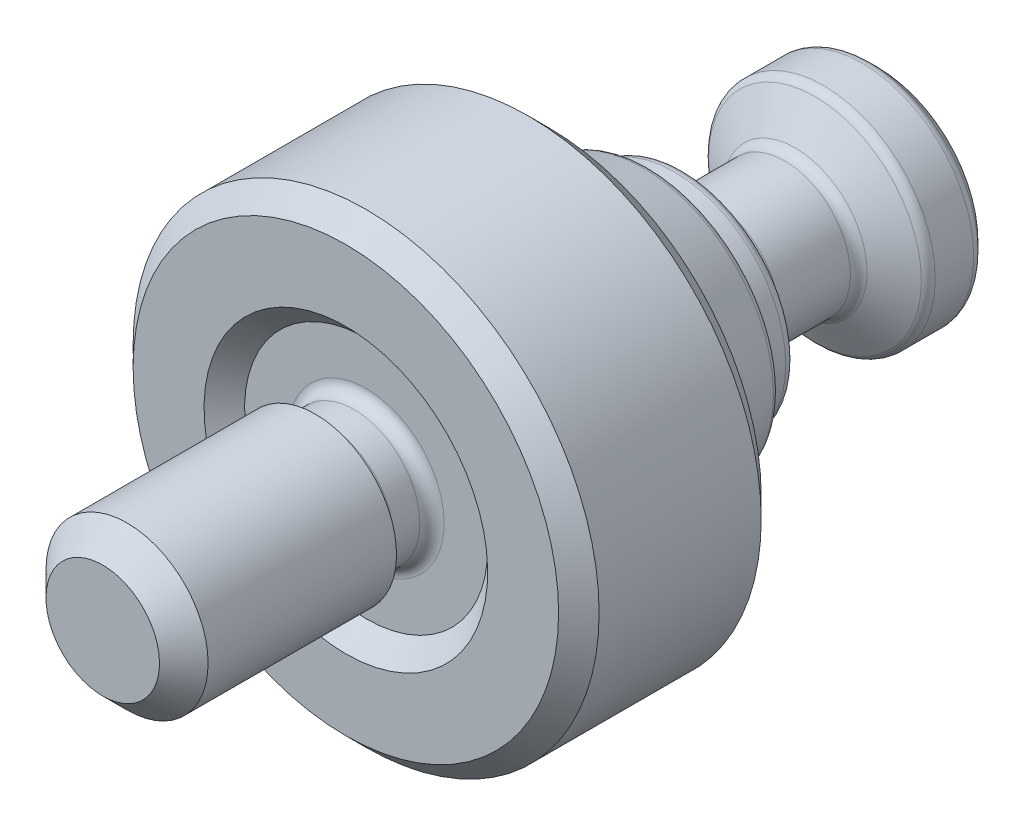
ISO-10303-21;
HEADER;
FILE_DESCRIPTION(('STEP AP214'),'2;1');
FILE_NAME('part.step','',(''),(''),'','','');
FILE_SCHEMA(('AUTOMOTIVE_DESIGN { 1 0 10303 214 1 1 1 1 }'));
ENDSEC;
DATA;
#1=APPLICATION_CONTEXT('core data for automotive mechanical design processes');
#2=APPLICATION_PROTOCOL_DEFINITION('international standard','automotive_design',2000,#1);
#3=PRODUCT_CONTEXT('',#1,'mechanical');
#4=PRODUCT('Part','Part','',(#3));
#5=PRODUCT_RELATED_PRODUCT_CATEGORY('part','',(#4));
#6=PRODUCT_DEFINITION_FORMATION('','',#4);
#7=PRODUCT_DEFINITION_CONTEXT('part definition',#1,'design');
#8=PRODUCT_DEFINITION('design','',#6,#7);
#9=PRODUCT_DEFINITION_SHAPE('','',#8);
#10=(LENGTH_UNIT() NAMED_UNIT(*) SI_UNIT(.MILLI.,.METRE.));
#11=(NAMED_UNIT(*) PLANE_ANGLE_UNIT() SI_UNIT($,.RADIAN.));
#12=(NAMED_UNIT(*) SI_UNIT($,.STERADIAN.) SOLID_ANGLE_UNIT());
#13=UNCERTAINTY_MEASURE_WITH_UNIT(LENGTH_MEASURE(1.E-05),#10,'distance_accuracy_value','');
#14=(GEOMETRIC_REPRESENTATION_CONTEXT(3) GLOBAL_UNCERTAINTY_ASSIGNED_CONTEXT((#13)) GLOBAL_UNIT_ASSIGNED_CONTEXT((#10,
#11,#12)) REPRESENTATION_CONTEXT('',''));
#15=CARTESIAN_POINT('',(0.,0.,0.));
#16=DIRECTION('',(0.,0.,1.));
#17=DIRECTION('',(1.,0.,0.));
#18=AXIS2_PLACEMENT_3D('',#15,#16,#17);
#19=CARTESIAN_POINT('',(0.,0.,9.));
#20=DIRECTION('',(0.,0.,-1.));
#21=DIRECTION('',(1.,0.,0.));
#22=AXIS2_PLACEMENT_3D('',#19,#20,#21);
#23=PLANE('',#22);
#24=CARTESIAN_POINT('',(0.,0.,9.));
#25=DIRECTION('',(0.,0.,1.));
#26=DIRECTION('',(0.,-1.,0.));
#27=AXIS2_PLACEMENT_3D('',#24,#25,#26);
#28=CIRCLE('',#27,3.85);
#29=CARTESIAN_POINT('',(0.,-3.85,9.));
#30=VERTEX_POINT('',#29);
#31=EDGE_CURVE('E23',#30,#30,#28,.T.);
#32=ORIENTED_EDGE('',*,*,#31,.F.);
#33=EDGE_LOOP('',(#32));
#34=FACE_BOUND('',#33,.T.);
#35=CARTESIAN_POINT('',(0.,0.,9.));
#36=DIRECTION('',(0.,0.,1.));
#37=DIRECTION('',(0.,-1.,0.));
#38=AXIS2_PLACEMENT_3D('',#35,#36,#37);
#39=CIRCLE('',#38,6.);
#40=CARTESIAN_POINT('',(0.,-6.,9.));
#41=VERTEX_POINT('',#40);
#42=EDGE_CURVE('E188',#41,#41,#39,.T.);
#43=ORIENTED_EDGE('',*,*,#42,.T.);
#44=EDGE_LOOP('',(#43));
#45=FACE_BOUND('',#44,.T.);
#46=ADVANCED_FACE('F14',(#34,#45),#23,.F.);
#47=CARTESIAN_POINT('',(0.,0.,22.));
#48=DIRECTION('',(0.,0.,1.));
#49=DIRECTION('',(0.,-1.,0.));
#50=AXIS2_PLACEMENT_3D('',#47,#48,#49);
#51=PLANE('',#50);
#52=CARTESIAN_POINT('',(0.,0.,22.));
#53=DIRECTION('',(0.,0.,1.));
#54=DIRECTION('',(0.,-1.,0.));
#55=AXIS2_PLACEMENT_3D('',#52,#53,#54);
#56=CIRCLE('',#55,2.8);
#57=CARTESIAN_POINT('',(0.,-2.8,22.));
#58=VERTEX_POINT('',#57);
#59=EDGE_CURVE('E119',#58,#58,#56,.T.);
#60=ORIENTED_EDGE('',*,*,#59,.T.);
#61=EDGE_LOOP('',(#60));
#62=FACE_BOUND('',#61,.T.);
#63=ADVANCED_FACE('F296',(#62),#51,.T.);
#64=CARTESIAN_POINT('',(0.,0.,20.8));
#65=DIRECTION('',(0.,0.,-1.));
#66=DIRECTION('',(0.,1.,0.));
#67=AXIS2_PLACEMENT_3D('',#64,#65,#66);
#68=CONICAL_SURFACE('',#67,4.,0.785398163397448);
#69=ORIENTED_EDGE('',*,*,#59,.F.);
#70=EDGE_LOOP('',(#69));
#71=FACE_BOUND('',#70,.T.);
#72=CARTESIAN_POINT('',(0.,0.,20.8));
#73=DIRECTION('',(0.,0.,1.));
#74=DIRECTION('',(0.,-1.,0.));
#75=AXIS2_PLACEMENT_3D('',#72,#73,#74);
#76=CIRCLE('',#75,4.);
#77=CARTESIAN_POINT('',(0.,-4.,20.8));
#78=VERTEX_POINT('',#77);
#79=EDGE_CURVE('E116',#78,#78,#76,.F.);
#80=ORIENTED_EDGE('',*,*,#79,.F.);
#81=EDGE_LOOP('',(#80));
#82=FACE_BOUND('',#81,.T.);
#83=ADVANCED_FACE('F289',(#71,#82),#68,.T.);
#84=CARTESIAN_POINT('',(0.,0.,0.));
#85=DIRECTION('',(0.,0.,-1.));
#86=DIRECTION('',(0.,1.,0.));
#87=AXIS2_PLACEMENT_3D('',#84,#85,#86);
#88=CYLINDRICAL_SURFACE('',#87,4.);
#89=CARTESIAN_POINT('',(0.,0.,11.5));
#90=DIRECTION('',(0.,0.,-1.));
#91=DIRECTION('',(0.,1.,0.));
#92=AXIS2_PLACEMENT_3D('',#89,#90,#91);
#93=CIRCLE('',#92,4.);
#94=CARTESIAN_POINT('',(0.,4.,11.5));
#95=VERTEX_POINT('',#94);
#96=EDGE_CURVE('E193',#95,#95,#93,.T.);
#97=ORIENTED_EDGE('',*,*,#96,.F.);
#98=EDGE_LOOP('',(#97));
#99=FACE_BOUND('',#98,.T.);
#100=ORIENTED_EDGE('',*,*,#79,.T.);
#101=EDGE_LOOP('',(#100));
#102=FACE_BOUND('',#101,.T.);
#103=ADVANCED_FACE('F280',(#99,#102),#88,.T.);
#104=CARTESIAN_POINT('',(4.,0.,11.5));
#105=DIRECTION('',(0.,0.,1.));
#106=DIRECTION('',(0.,-1.,0.));
#107=AXIS2_PLACEMENT_3D('',#104,#105,#106);
#108=PLANE('',#107);
#109=CARTESIAN_POINT('',(0.,0.,11.5));
#110=DIRECTION('',(0.,0.,1.));
#111=DIRECTION('',(0.,-1.,0.));
#112=AXIS2_PLACEMENT_3D('',#109,#110,#111);
#113=CIRCLE('',#112,3.85);
#114=CARTESIAN_POINT('',(0.,-3.85,11.5));
#115=VERTEX_POINT('',#114);
#116=EDGE_CURVE('E18',#115,#115,#113,.T.);
#117=ORIENTED_EDGE('',*,*,#116,.T.);
#118=EDGE_LOOP('',(#117));
#119=FACE_BOUND('',#118,.T.);
#120=ORIENTED_EDGE('',*,*,#96,.T.);
#121=EDGE_LOOP('',(#120));
#122=FACE_BOUND('',#121,.T.);
#123=ADVANCED_FACE('F277',(#119,#122),#108,.F.);
#124=CARTESIAN_POINT('',(0.,0.,10.9));
#125=DIRECTION('',(0.,0.,1.));
#126=DIRECTION('',(0.,-1.,0.));
#127=AXIS2_PLACEMENT_3D('',#124,#125,#126);
#128=TOROIDAL_SURFACE('',#127,3.85,0.6);
#129=ORIENTED_EDGE('',*,*,#116,.F.);
#130=EDGE_LOOP('',(#129));
#131=FACE_BOUND('',#130,.T.);
#132=CARTESIAN_POINT('',(0.,0.,10.9));
#133=DIRECTION('',(0.,0.,1.));
#134=DIRECTION('',(0.,-1.,0.));
#135=AXIS2_PLACEMENT_3D('',#132,#133,#134);
#136=CIRCLE('',#135,3.25);
#137=CARTESIAN_POINT('',(0.,-3.25,10.9));
#138=VERTEX_POINT('',#137);
#139=EDGE_CURVE('E163',#138,#138,#136,.F.);
#140=ORIENTED_EDGE('',*,*,#139,.F.);
#141=EDGE_LOOP('',(#140));
#142=FACE_BOUND('',#141,.T.);
#143=ADVANCED_FACE('F279',(#131,#142),#128,.F.);
#144=CARTESIAN_POINT('',(0.,0.,0.));
#145=DIRECTION('',(0.,0.,-1.));
#146=DIRECTION('',(0.,1.,0.));
#147=AXIS2_PLACEMENT_3D('',#144,#145,#146);
#148=CYLINDRICAL_SURFACE('',#147,3.25);
#149=ORIENTED_EDGE('',*,*,#139,.T.);
#150=EDGE_LOOP('',(#149));
#151=FACE_BOUND('',#150,.T.);
#152=CARTESIAN_POINT('',(0.,0.,9.6));
#153=DIRECTION('',(0.,0.,1.));
#154=DIRECTION('',(0.,-1.,0.));
#155=AXIS2_PLACEMENT_3D('',#152,#153,#154);
#156=CIRCLE('',#155,3.25);
#157=CARTESIAN_POINT('',(0.,-3.25,9.6));
#158=VERTEX_POINT('',#157);
#159=EDGE_CURVE('E161',#158,#158,#156,.T.);
#160=ORIENTED_EDGE('',*,*,#159,.T.);
#161=EDGE_LOOP('',(#160));
#162=FACE_BOUND('',#161,.T.);
#163=ADVANCED_FACE('F282',(#151,#162),#148,.T.);
#164=CARTESIAN_POINT('',(0.,0.,9.6));
#165=DIRECTION('',(0.,0.,1.));
#166=DIRECTION('',(0.,-1.,0.));
#167=AXIS2_PLACEMENT_3D('',#164,#165,#166);
#168=TOROIDAL_SURFACE('',#167,3.85,0.6);
#169=ORIENTED_EDGE('',*,*,#159,.F.);
#170=EDGE_LOOP('',(#169));
#171=FACE_BOUND('',#170,.T.);
#172=ORIENTED_EDGE('',*,*,#31,.T.);
#173=EDGE_LOOP('',(#172));
#174=FACE_BOUND('',#173,.T.);
#175=ADVANCED_FACE('F16',(#171,#174),#168,.F.);
#176=CARTESIAN_POINT('',(0.,0.,9.));
#177=DIRECTION('',(0.,0.,-1.));
#178=DIRECTION('',(0.,1.,0.));
#179=AXIS2_PLACEMENT_3D('',#176,#177,#178);
#180=CONICAL_SURFACE('',#179,11.5,0.785398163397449);
#181=CARTESIAN_POINT('',(0.,0.,10.));
#182=DIRECTION('',(0.,0.,1.));
#183=DIRECTION('',(0.,-1.,0.));
#184=AXIS2_PLACEMENT_3D('',#181,#182,#183);
#185=CIRCLE('',#184,10.5);
#186=CARTESIAN_POINT('',(0.,-10.5,10.));
#187=VERTEX_POINT('',#186);
#188=EDGE_CURVE('E177',#187,#187,#185,.T.);
#189=ORIENTED_EDGE('',*,*,#188,.F.);
#190=EDGE_LOOP('',(#189));
#191=FACE_BOUND('',#190,.T.);
#192=CARTESIAN_POINT('',(0.,0.,9.));
#193=DIRECTION('',(0.,0.,1.));
#194=DIRECTION('',(0.,-1.,0.));
#195=AXIS2_PLACEMENT_3D('',#192,#193,#194);
#196=CIRCLE('',#195,11.5);
#197=CARTESIAN_POINT('',(0.,-11.5,9.));
#198=VERTEX_POINT('',#197);
#199=EDGE_CURVE('E172',#198,#198,#196,.F.);
#200=ORIENTED_EDGE('',*,*,#199,.F.);
#201=EDGE_LOOP('',(#200));
#202=FACE_BOUND('',#201,.T.);
#203=ADVANCED_FACE('F301',(#191,#202),#180,.T.);
#204=CARTESIAN_POINT('',(6.,0.,10.));
#205=DIRECTION('',(0.,0.,1.));
#206=DIRECTION('',(0.,-1.,0.));
#207=AXIS2_PLACEMENT_3D('',#204,#205,#206);
#208=PLANE('',#207);
#209=CARTESIAN_POINT('',(0.,0.,10.));
#210=DIRECTION('',(0.,0.,1.));
#211=DIRECTION('',(0.,-1.,0.));
#212=AXIS2_PLACEMENT_3D('',#209,#210,#211);
#213=CIRCLE('',#212,7.);
#214=CARTESIAN_POINT('',(0.,-7.,10.));
#215=VERTEX_POINT('',#214);
#216=EDGE_CURVE('E185',#215,#215,#213,.F.);
#217=ORIENTED_EDGE('',*,*,#216,.T.);
#218=EDGE_LOOP('',(#217));
#219=FACE_BOUND('',#218,.T.);
#220=ORIENTED_EDGE('',*,*,#188,.T.);
#221=EDGE_LOOP('',(#220));
#222=FACE_BOUND('',#221,.T.);
#223=ADVANCED_FACE('F389',(#219,#222),#208,.T.);
#224=CARTESIAN_POINT('',(0.,0.,10.));
#225=DIRECTION('',(0.,0.,1.));
#226=DIRECTION('',(0.,-1.,0.));
#227=AXIS2_PLACEMENT_3D('',#224,#225,#226);
#228=CONICAL_SURFACE('',#227,7.,0.785398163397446);
#229=ORIENTED_EDGE('',*,*,#42,.F.);
#230=EDGE_LOOP('',(#229));
#231=FACE_BOUND('',#230,.T.);
#232=ORIENTED_EDGE('',*,*,#216,.F.);
#233=EDGE_LOOP('',(#232));
#234=FACE_BOUND('',#233,.T.);
#235=ADVANCED_FACE('F393',(#231,#234),#228,.F.);
#236=CARTESIAN_POINT('',(0.,0.,0.));
#237=DIRECTION('',(0.,0.,-1.));
#238=DIRECTION('',(0.,1.,0.));
#239=AXIS2_PLACEMENT_3D('',#236,#237,#238);
#240=CYLINDRICAL_SURFACE('',#239,11.5);
#241=ORIENTED_EDGE('',*,*,#199,.T.);
#242=EDGE_LOOP('',(#241));
#243=FACE_BOUND('',#242,.T.);
#244=CARTESIAN_POINT('',(0.,0.,1.));
#245=DIRECTION('',(0.,0.,-1.));
#246=DIRECTION('',(0.,1.,0.));
#247=AXIS2_PLACEMENT_3D('',#244,#245,#246);
#248=CIRCLE('',#247,11.5);
#249=CARTESIAN_POINT('',(0.,11.5,1.));
#250=VERTEX_POINT('',#249);
#251=EDGE_CURVE('E168',#250,#250,#248,.F.);
#252=ORIENTED_EDGE('',*,*,#251,.T.);
#253=EDGE_LOOP('',(#252));
#254=FACE_BOUND('',#253,.T.);
#255=ADVANCED_FACE('F383',(#243,#254),#240,.T.);
#256=CARTESIAN_POINT('',(0.,0.,0.));
#257=DIRECTION('',(0.,0.,1.));
#258=DIRECTION('',(0.,-1.,0.));
#259=AXIS2_PLACEMENT_3D('',#256,#257,#258);
#260=CONICAL_SURFACE('',#259,10.5,0.785398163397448);
#261=ORIENTED_EDGE('',*,*,#251,.F.);
#262=EDGE_LOOP('',(#261));
#263=FACE_BOUND('',#262,.T.);
#264=CARTESIAN_POINT('',(0.,0.,0.));
#265=DIRECTION('',(0.,0.,-1.));
#266=DIRECTION('',(0.,1.,0.));
#267=AXIS2_PLACEMENT_3D('',#264,#265,#266);
#268=CIRCLE('',#267,10.5);
#269=CARTESIAN_POINT('',(0.,10.5,0.));
#270=VERTEX_POINT('',#269);
#271=EDGE_CURVE('E182',#270,#270,#268,.T.);
#272=ORIENTED_EDGE('',*,*,#271,.F.);
#273=EDGE_LOOP('',(#272));
#274=FACE_BOUND('',#273,.T.);
#275=ADVANCED_FACE('F375',(#263,#274),#260,.T.);
#276=CARTESIAN_POINT('',(11.5,0.,0.));
#277=DIRECTION('',(0.,0.,-1.));
#278=DIRECTION('',(0.,1.,0.));
#279=AXIS2_PLACEMENT_3D('',#276,#277,#278);
#280=PLANE('',#279);
#281=ORIENTED_EDGE('',*,*,#271,.T.);
#282=EDGE_LOOP('',(#281));
#283=FACE_BOUND('',#282,.T.);
#284=CARTESIAN_POINT('',(0.,0.,0.));
#285=DIRECTION('',(0.,0.,-1.));
#286=DIRECTION('',(0.,1.,0.));
#287=AXIS2_PLACEMENT_3D('',#284,#285,#286);
#288=CIRCLE('',#287,7.3);
#289=CARTESIAN_POINT('',(0.,7.3,0.));
#290=VERTEX_POINT('',#289);
#291=EDGE_CURVE('E9',#290,#290,#288,.T.);
#292=ORIENTED_EDGE('',*,*,#291,.F.);
#293=EDGE_LOOP('',(#292));
#294=FACE_BOUND('',#293,.T.);
#295=ADVANCED_FACE('F364',(#283,#294),#280,.T.);
#296=CARTESIAN_POINT('',(1.73205080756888,0.,-14.));
#297=DIRECTION('',(0.,0.,-1.));
#298=DIRECTION('',(0.,1.,0.));
#299=AXIS2_PLACEMENT_3D('',#296,#297,#298);
#300=PLANE('',#299);
#301=DIRECTION('',(-0.5,0.866025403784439,0.));
#302=VECTOR('',#301,1.);
#303=CARTESIAN_POINT('',(-0.866025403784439,-1.5,-14.));
#304=LINE('',#303,#302);
#305=CARTESIAN_POINT('',(-0.866025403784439,-1.5,-14.));
#306=VERTEX_POINT('',#305);
#307=CARTESIAN_POINT('',(-1.73205080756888,0.,-14.));
#308=VERTEX_POINT('',#307);
#309=EDGE_CURVE('E699',#306,#308,#304,.T.);
#310=ORIENTED_EDGE('',*,*,#309,.T.);
#311=DIRECTION('',(0.5,0.866025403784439,0.));
#312=VECTOR('',#311,1.);
#313=CARTESIAN_POINT('',(-1.73205080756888,0.,-14.));
#314=LINE('',#313,#312);
#315=CARTESIAN_POINT('',(-0.866025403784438,1.5,-14.));
#316=VERTEX_POINT('',#315);
#317=EDGE_CURVE('E700',#308,#316,#314,.T.);
#318=ORIENTED_EDGE('',*,*,#317,.T.);
#319=DIRECTION('',(1.,0.,0.));
#320=VECTOR('',#319,1.);
#321=CARTESIAN_POINT('',(-0.866025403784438,1.5,-14.));
#322=LINE('',#321,#320);
#323=CARTESIAN_POINT('',(0.86602540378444,1.5,-14.));
#324=VERTEX_POINT('',#323);
#325=EDGE_CURVE('E39',#316,#324,#322,.T.);
#326=ORIENTED_EDGE('',*,*,#325,.T.);
#327=DIRECTION('',(0.5,-0.866025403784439,0.));
#328=VECTOR('',#327,1.);
#329=CARTESIAN_POINT('',(0.86602540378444,1.5,-14.));
#330=LINE('',#329,#328);
#331=CARTESIAN_POINT('',(1.73205080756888,0.,-14.));
#332=VERTEX_POINT('',#331);
#333=EDGE_CURVE('E87',#324,#332,#330,.T.);
#334=ORIENTED_EDGE('',*,*,#333,.T.);
#335=DIRECTION('',(-0.5,-0.866025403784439,0.));
#336=VECTOR('',#335,1.);
#337=CARTESIAN_POINT('',(1.73205080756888,0.,-14.));
#338=LINE('',#337,#336);
#339=CARTESIAN_POINT('',(0.866025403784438,-1.5,-14.));
#340=VERTEX_POINT('',#339);
#341=EDGE_CURVE('E703',#332,#340,#338,.T.);
#342=ORIENTED_EDGE('',*,*,#341,.T.);
#343=DIRECTION('',(-1.,0.,0.));
#344=VECTOR('',#343,1.);
#345=CARTESIAN_POINT('',(0.866025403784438,-1.5,-14.));
#346=LINE('',#345,#344);
#347=EDGE_CURVE('E701',#340,#306,#346,.T.);
#348=ORIENTED_EDGE('',*,*,#347,.T.);
#349=EDGE_LOOP('',(#310,#318,#326,#334,#342,#348));
#350=FACE_BOUND('',#349,.T.);
#351=ADVANCED_FACE('F261',(#350),#300,.T.);
#352=CARTESIAN_POINT('',(0.866025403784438,-1.5,-14.));
#353=DIRECTION('',(0.,-1.,0.));
#354=DIRECTION('',(1.,0.,0.));
#355=AXIS2_PLACEMENT_3D('',#352,#353,#354);
#356=PLANE('',#355);
#357=CARTESIAN_POINT('',(-2.28397410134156,-1.5,-16.9229071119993));
#358=CARTESIAN_POINT('',(-2.21878991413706,-1.5,-16.8914593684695));
#359=CARTESIAN_POINT('',(-2.1534515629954,-1.5,-16.8603257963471));
#360=CARTESIAN_POINT('',(-2.02238403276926,-1.5,-16.7988644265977));
#361=CARTESIAN_POINT('',(-1.95665478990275,-1.5,-16.7685367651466));
#362=CARTESIAN_POINT('',(-1.82436364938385,-1.5,-16.7087029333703));
#363=CARTESIAN_POINT('',(-1.75779913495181,-1.5,-16.6792025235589));
#364=CARTESIAN_POINT('',(-1.62412650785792,-1.5,-16.6214679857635));
#365=CARTESIAN_POINT('',(-1.55701842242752,-1.5,-16.5932337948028));
#366=CARTESIAN_POINT('',(-1.42017535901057,-1.5,-16.537561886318));
#367=CARTESIAN_POINT('',(-1.35042088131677,-1.5,-16.5101714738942));
#368=CARTESIAN_POINT('',(-1.21009481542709,-1.5,-16.4575777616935));
#369=CARTESIAN_POINT('',(-1.13952312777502,-1.5,-16.4323747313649));
#370=CARTESIAN_POINT('',(-0.926675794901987,-1.5,-16.3610629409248));
#371=CARTESIAN_POINT('',(-0.782896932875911,-1.5,-16.3190937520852));
#372=CARTESIAN_POINT('',(-0.564495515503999,-1.5,-16.2698234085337));
#373=CARTESIAN_POINT('',(-0.491421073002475,-1.5,-16.2556984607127));
#374=CARTESIAN_POINT('',(-0.344405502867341,-1.5,-16.2329184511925));
#375=CARTESIAN_POINT('',(-0.270464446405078,-1.5,-16.2242629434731));
#376=CARTESIAN_POINT('',(-0.123035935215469,-1.5,-16.2132228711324));
#377=CARTESIAN_POINT('',(-0.0495544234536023,-1.5,-16.2107610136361));
#378=CARTESIAN_POINT('',(0.097348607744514,-1.5,-16.212108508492));
#379=CARTESIAN_POINT('',(0.170770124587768,-1.5,-16.2159181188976));
#380=CARTESIAN_POINT('',(0.349490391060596,-1.5,-16.2324885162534));
#381=CARTESIAN_POINT('',(0.454491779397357,-1.5,-16.2484687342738));
#382=CARTESIAN_POINT('',(0.662502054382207,-1.5,-16.2903432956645));
#383=CARTESIAN_POINT('',(0.765508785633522,-1.5,-16.3162477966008));
#384=CARTESIAN_POINT('',(0.971670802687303,-1.5,-16.3758329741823));
#385=CARTESIAN_POINT('',(1.07477868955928,-1.5,-16.409673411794));
#386=CARTESIAN_POINT('',(1.27908955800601,-1.5,-16.4824928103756));
#387=CARTESIAN_POINT('',(1.38029312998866,-1.5,-16.521470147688));
#388=CARTESIAN_POINT('',(1.62283010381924,-1.5,-16.6198322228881));
#389=CARTESIAN_POINT('',(1.76343848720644,-1.5,-16.6809869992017));
#390=CARTESIAN_POINT('',(2.04270262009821,-1.5,-16.8076296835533));
#391=CARTESIAN_POINT('',(2.18135782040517,-1.5,-16.8731187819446));
#392=CARTESIAN_POINT('',(2.45744376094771,-1.5,-17.0069670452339));
#393=CARTESIAN_POINT('',(2.59487311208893,-1.5,-17.0753290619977));
#394=CARTESIAN_POINT('',(2.8687740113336,-1.5,-17.2139473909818));
#395=CARTESIAN_POINT('',(3.00524552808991,-1.5,-17.2842037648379));
#396=CARTESIAN_POINT('',(3.26576619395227,-1.5,-17.4199372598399));
#397=CARTESIAN_POINT('',(3.3898726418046,-1.5,-17.4853046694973));
#398=CARTESIAN_POINT('',(3.63764859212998,-1.5,-17.6168720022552));
#399=CARTESIAN_POINT('',(3.76131807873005,-1.5,-17.6830719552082));
#400=CARTESIAN_POINT('',(4.00801757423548,-1.5,-17.8159423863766));
#401=CARTESIAN_POINT('',(4.13104840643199,-1.5,-17.8826113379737));
#402=CARTESIAN_POINT('',(4.37683251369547,-1.5,-18.0164434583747));
#403=CARTESIAN_POINT('',(4.49958580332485,-1.5,-18.0836066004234));
#404=CARTESIAN_POINT('',(4.62223761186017,-1.5,-18.1509533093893));
#405=B_SPLINE_CURVE_WITH_KNOTS('',3,(#357,#358,#359,#360,#361,#362,#363,#364,#365,#366,#367,
#368,#369,#370,#371,#372,#373,#374,#375,#376,#377,#378,#379,#380,#381,#382,#383,#384,#385,#386,
#387,#388,#389,#390,#391,#392,#393,#394,#395,#396,#397,#398,#399,#400,#401,#402,#403,#404),
.UNSPECIFIED.,.F.,.F.,(4,2,2,2,2,2,2,2,2,2,2,2,2,2,2,2,2,2,2,2,2,2,2,4),(0.,0.217123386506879,
0.434283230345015,0.652698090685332,0.871102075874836,1.09588117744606,1.3206879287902,
1.76909391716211,1.99221104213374,2.21530997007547,2.43561063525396,2.65592036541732,
2.9738941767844,3.29219430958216,3.61755574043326,3.94281457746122,4.40267752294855,
4.86266729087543,5.32312499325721,5.78359769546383,6.2043998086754,6.62521705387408,
7.04501578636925,7.46479195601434),.UNSPECIFIED.);
#406=CARTESIAN_POINT('',(-0.866025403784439,-1.5,-16.3452994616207));
#407=VERTEX_POINT('',#406);
#408=CARTESIAN_POINT('',(0.866025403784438,-1.5,-16.3452994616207));
#409=VERTEX_POINT('',#408);
#410=EDGE_CURVE('E246',#407,#409,#405,.T.);
#411=ORIENTED_EDGE('',*,*,#410,.F.);
#412=DIRECTION('',(0.,0.,-1.));
#413=VECTOR('',#412,1.);
#414=CARTESIAN_POINT('',(-0.866025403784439,-1.5,-14.));
#415=LINE('',#414,#413);
#416=EDGE_CURVE('E100',#306,#407,#415,.T.);
#417=ORIENTED_EDGE('',*,*,#416,.F.);
#418=ORIENTED_EDGE('',*,*,#347,.F.);
#419=DIRECTION('',(0.,0.,-1.));
#420=VECTOR('',#419,1.);
#421=CARTESIAN_POINT('',(0.866025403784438,-1.5,-14.));
#422=LINE('',#421,#420);
#423=EDGE_CURVE('E103',#340,#409,#422,.T.);
#424=ORIENTED_EDGE('',*,*,#423,.T.);
#425=EDGE_LOOP('',(#411,#417,#418,#424));
#426=FACE_BOUND('',#425,.T.);
#427=ADVANCED_FACE('F257',(#426),#356,.F.);
#428=CARTESIAN_POINT('',(-0.866025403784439,-1.5,-14.));
#429=DIRECTION('',(-0.866025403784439,-0.5,0.));
#430=DIRECTION('',(0.5,-0.866025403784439,0.));
#431=AXIS2_PLACEMENT_3D('',#428,#429,#430);
#432=PLANE('',#431);
#433=CARTESIAN_POINT('',(-1.73216627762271,0.000199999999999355,-16.3453661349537));
#434=CARTESIAN_POINT('',(-1.69410775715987,-0.0657192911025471,-16.3233823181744));
#435=CARTESIAN_POINT('',(-1.65572072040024,-0.132207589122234,-16.303388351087));
#436=CARTESIAN_POINT('',(-1.5782818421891,-0.26633566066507,-16.2684875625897));
#437=CARTESIAN_POINT('',(-1.53922862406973,-0.333977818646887,-16.2535930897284));
#438=CARTESIAN_POINT('',(-1.4616062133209,-0.468423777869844,-16.2304061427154));
#439=CARTESIAN_POINT('',(-1.42304896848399,-0.535206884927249,-16.221959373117));
#440=CARTESIAN_POINT('',(-1.34575291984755,-0.669087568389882,-16.211873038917));
#441=CARTESIAN_POINT('',(-1.30701439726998,-0.73618465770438,-16.2102251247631));
#442=CARTESIAN_POINT('',(-1.23462040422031,-0.861574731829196,-16.2136410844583));
#443=CARTESIAN_POINT('',(-1.20095413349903,-0.91988642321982,-16.2178662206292));
#444=CARTESIAN_POINT('',(-1.13384094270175,-1.03612987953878,-16.2312612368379));
#445=CARTESIAN_POINT('',(-1.10039425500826,-1.09406124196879,-16.240435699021));
#446=CARTESIAN_POINT('',(-1.03314252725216,-1.21054465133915,-16.2633726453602));
#447=CARTESIAN_POINT('',(-0.999346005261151,-1.26908194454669,-16.2772324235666));
#448=CARTESIAN_POINT('',(-0.932257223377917,-1.38528312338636,-16.3086892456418));
#449=CARTESIAN_POINT('',(-0.89896410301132,-1.44294849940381,-16.3262788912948));
#450=CARTESIAN_POINT('',(-0.865909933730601,-1.5002,-16.3453661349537));
#451=B_SPLINE_CURVE_WITH_KNOTS('',3,(#433,#434,#435,#436,#437,#438,#439,#440,#441,#442,#443,
#444,#445,#446,#447,#448,#449,#450),.UNSPECIFIED.,.F.,.F.,(4,2,2,2,2,2,2,2,4),(0.,
0.237777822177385,0.476127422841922,0.708577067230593,0.940741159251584,1.14294352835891,
1.34533342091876,1.55221450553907,1.75868901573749),.UNSPECIFIED.);
#452=CARTESIAN_POINT('',(-1.73205080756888,0.,-16.3452994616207));
#453=VERTEX_POINT('',#452);
#454=EDGE_CURVE('E239',#453,#407,#451,.T.);
#455=ORIENTED_EDGE('',*,*,#454,.F.);
#456=DIRECTION('',(0.,0.,-1.));
#457=VECTOR('',#456,1.);
#458=CARTESIAN_POINT('',(-1.73205080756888,0.,-14.));
#459=LINE('',#458,#457);
#460=EDGE_CURVE('E93',#308,#453,#459,.T.);
#461=ORIENTED_EDGE('',*,*,#460,.F.);
#462=ORIENTED_EDGE('',*,*,#309,.F.);
#463=ORIENTED_EDGE('',*,*,#416,.T.);
#464=EDGE_LOOP('',(#455,#461,#462,#463));
#465=FACE_BOUND('',#464,.T.);
#466=ADVANCED_FACE('F260',(#465),#432,.F.);
#467=CARTESIAN_POINT('',(-1.73205080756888,0.,-14.));
#468=DIRECTION('',(-0.866025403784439,0.5,0.));
#469=DIRECTION('',(-0.5,-0.866025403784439,0.));
#470=AXIS2_PLACEMENT_3D('',#467,#468,#469);
#471=PLANE('',#470);
#472=CARTESIAN_POINT('',(-0.865909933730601,1.5002,-16.3453661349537));
#473=CARTESIAN_POINT('',(-0.903968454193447,1.43428070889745,-16.3233823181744));
#474=CARTESIAN_POINT('',(-0.942355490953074,1.36779241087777,-16.303388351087));
#475=CARTESIAN_POINT('',(-1.01979436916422,1.23366433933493,-16.2684875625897));
#476=CARTESIAN_POINT('',(-1.05884758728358,1.16602218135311,-16.2535930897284));
#477=CARTESIAN_POINT('',(-1.13646999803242,1.03157622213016,-16.2304061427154));
#478=CARTESIAN_POINT('',(-1.17502724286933,0.964793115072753,-16.221959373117));
#479=CARTESIAN_POINT('',(-1.25232329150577,0.83091243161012,-16.211873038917));
#480=CARTESIAN_POINT('',(-1.29106181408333,0.763815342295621,-16.2102251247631));
#481=CARTESIAN_POINT('',(-1.363455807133,0.638425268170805,-16.2136410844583));
#482=CARTESIAN_POINT('',(-1.39712207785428,0.580113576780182,-16.2178662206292));
#483=CARTESIAN_POINT('',(-1.46423526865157,0.46387012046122,-16.2312612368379));
#484=CARTESIAN_POINT('',(-1.49768195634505,0.405938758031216,-16.240435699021));
#485=CARTESIAN_POINT('',(-1.56493368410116,0.289455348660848,-16.2633726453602));
#486=CARTESIAN_POINT('',(-1.59873020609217,0.230918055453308,-16.2772324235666));
#487=CARTESIAN_POINT('',(-1.6658189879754,0.114716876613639,-16.3086892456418));
#488=CARTESIAN_POINT('',(-1.699112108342,0.0570515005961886,-16.3262788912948));
#489=CARTESIAN_POINT('',(-1.73216627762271,-0.000200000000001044,-16.3453661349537));
#490=B_SPLINE_CURVE_WITH_KNOTS('',3,(#472,#473,#474,#475,#476,#477,#478,#479,#480,#481,#482,
#483,#484,#485,#486,#487,#488,#489),.UNSPECIFIED.,.F.,.F.,(4,2,2,2,2,2,2,2,4),(0.,
0.237777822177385,0.476127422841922,0.708577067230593,0.940741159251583,1.14294352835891,
1.34533342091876,1.55221450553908,1.75868901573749),.UNSPECIFIED.);
#491=CARTESIAN_POINT('',(-0.866025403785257,1.5,-16.3452994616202));
#492=VERTEX_POINT('',#491);
#493=EDGE_CURVE('E84',#492,#453,#490,.T.);
#494=ORIENTED_EDGE('',*,*,#493,.F.);
#495=DIRECTION('',(0.,0.,-1.));
#496=VECTOR('',#495,1.);
#497=CARTESIAN_POINT('',(-0.866025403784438,1.5,-14.));
#498=LINE('',#497,#496);
#499=EDGE_CURVE('E83',#316,#492,#498,.T.);
#500=ORIENTED_EDGE('',*,*,#499,.F.);
#501=ORIENTED_EDGE('',*,*,#317,.F.);
#502=ORIENTED_EDGE('',*,*,#460,.T.);
#503=EDGE_LOOP('',(#494,#500,#501,#502));
#504=FACE_BOUND('',#503,.T.);
#505=ADVANCED_FACE('F577',(#504),#471,.F.);
#506=CARTESIAN_POINT('',(-0.866025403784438,1.5,-14.));
#507=DIRECTION('',(0.,1.,0.));
#508=DIRECTION('',(-1.,0.,0.));
#509=AXIS2_PLACEMENT_3D('',#506,#507,#508);
#510=PLANE('',#509);
#511=CARTESIAN_POINT('',(-2.28397410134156,1.5,-16.9229071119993));
#512=CARTESIAN_POINT('',(-2.21878991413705,1.5,-16.8914593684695));
#513=CARTESIAN_POINT('',(-2.1534515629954,1.5,-16.8603257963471));
#514=CARTESIAN_POINT('',(-2.02238403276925,1.5,-16.7988644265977));
#515=CARTESIAN_POINT('',(-1.95665478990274,1.5,-16.7685367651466));
#516=CARTESIAN_POINT('',(-1.82436364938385,1.5,-16.7087029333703));
#517=CARTESIAN_POINT('',(-1.75779913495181,1.5,-16.6792025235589));
#518=CARTESIAN_POINT('',(-1.62412650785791,1.5,-16.6214679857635));
#519=CARTESIAN_POINT('',(-1.55701842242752,1.5,-16.5932337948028));
#520=CARTESIAN_POINT('',(-1.42017535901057,1.5,-16.537561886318));
#521=CARTESIAN_POINT('',(-1.35042088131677,1.5,-16.5101714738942));
#522=CARTESIAN_POINT('',(-1.21009481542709,1.5,-16.4575777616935));
#523=CARTESIAN_POINT('',(-1.13952312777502,1.5,-16.4323747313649));
#524=CARTESIAN_POINT('',(-0.926675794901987,1.5,-16.3610629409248));
#525=CARTESIAN_POINT('',(-0.782896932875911,1.5,-16.3190937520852));
#526=CARTESIAN_POINT('',(-0.564495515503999,1.5,-16.2698234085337));
#527=CARTESIAN_POINT('',(-0.491421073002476,1.5,-16.2556984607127));
#528=CARTESIAN_POINT('',(-0.344405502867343,1.5,-16.2329184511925));
#529=CARTESIAN_POINT('',(-0.27046444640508,1.5,-16.2242629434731));
#530=CARTESIAN_POINT('',(-0.123035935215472,1.5,-16.2132228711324));
#531=CARTESIAN_POINT('',(-0.0495544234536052,1.5,-16.2107610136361));
#532=CARTESIAN_POINT('',(0.0973486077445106,1.5,-16.212108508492));
#533=CARTESIAN_POINT('',(0.170770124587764,1.5,-16.2159181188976));
#534=CARTESIAN_POINT('',(0.349490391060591,1.5,-16.2324885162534));
#535=CARTESIAN_POINT('',(0.454491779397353,1.5,-16.2484687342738));
#536=CARTESIAN_POINT('',(0.662502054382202,1.5,-16.2903432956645));
#537=CARTESIAN_POINT('',(0.765508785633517,1.5,-16.3162477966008));
#538=CARTESIAN_POINT('',(0.971670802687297,1.5,-16.3758329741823));
#539=CARTESIAN_POINT('',(1.07477868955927,1.5,-16.409673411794));
#540=CARTESIAN_POINT('',(1.279089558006,1.5,-16.4824928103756));
#541=CARTESIAN_POINT('',(1.38029312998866,1.5,-16.521470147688));
#542=CARTESIAN_POINT('',(1.62283010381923,1.5,-16.6198322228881));
#543=CARTESIAN_POINT('',(1.76343848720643,1.5,-16.6809869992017));
#544=CARTESIAN_POINT('',(2.0427026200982,1.5,-16.8076296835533));
#545=CARTESIAN_POINT('',(2.18135782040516,1.5,-16.8731187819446));
#546=CARTESIAN_POINT('',(2.4574437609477,1.5,-17.0069670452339));
#547=CARTESIAN_POINT('',(2.59487311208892,1.5,-17.0753290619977));
#548=CARTESIAN_POINT('',(2.86877401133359,1.5,-17.2139473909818));
#549=CARTESIAN_POINT('',(3.0052455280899,1.5,-17.2842037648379));
#550=CARTESIAN_POINT('',(3.26576619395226,1.5,-17.4199372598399));
#551=CARTESIAN_POINT('',(3.38987264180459,1.5,-17.4853046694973));
#552=CARTESIAN_POINT('',(3.63764859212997,1.5,-17.6168720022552));
#553=CARTESIAN_POINT('',(3.76131807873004,1.5,-17.6830719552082));
#554=CARTESIAN_POINT('',(4.00801757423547,1.5,-17.8159423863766));
#555=CARTESIAN_POINT('',(4.13104840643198,1.5,-17.8826113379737));
#556=CARTESIAN_POINT('',(4.37683251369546,1.5,-18.0164434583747));
#557=CARTESIAN_POINT('',(4.49958580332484,1.5,-18.0836066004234));
#558=CARTESIAN_POINT('',(4.62223761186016,1.5,-18.1509533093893));
#559=B_SPLINE_CURVE_WITH_KNOTS('',3,(#511,#512,#513,#514,#515,#516,#517,#518,#519,#520,#521,
#522,#523,#524,#525,#526,#527,#528,#529,#530,#531,#532,#533,#534,#535,#536,#537,#538,#539,#540,
#541,#542,#543,#544,#545,#546,#547,#548,#549,#550,#551,#552,#553,#554,#555,#556,#557,#558),
.UNSPECIFIED.,.F.,.F.,(4,2,2,2,2,2,2,2,2,2,2,2,2,2,2,2,2,2,2,2,2,2,2,4),(0.,0.217123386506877,
0.434283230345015,0.65269809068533,0.871102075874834,1.09588117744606,1.3206879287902,
1.7690939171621,1.99221104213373,2.21530997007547,2.43561063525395,2.65592036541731,
2.9738941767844,3.29219430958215,3.61755574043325,3.94281457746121,4.40267752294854,
4.86266729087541,5.3231249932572,5.78359769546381,6.20439980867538,6.62521705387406,
7.04501578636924,7.46479195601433),.UNSPECIFIED.);
#560=CARTESIAN_POINT('',(0.86602540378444,1.5,-16.3452994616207));
#561=VERTEX_POINT('',#560);
#562=EDGE_CURVE('E69',#561,#492,#559,.F.);
#563=ORIENTED_EDGE('',*,*,#562,.F.);
#564=DIRECTION('',(0.,0.,-1.));
#565=VECTOR('',#564,1.);
#566=CARTESIAN_POINT('',(0.86602540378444,1.5,-14.));
#567=LINE('',#566,#565);
#568=EDGE_CURVE('E80',#324,#561,#567,.T.);
#569=ORIENTED_EDGE('',*,*,#568,.F.);
#570=ORIENTED_EDGE('',*,*,#325,.F.);
#571=ORIENTED_EDGE('',*,*,#499,.T.);
#572=EDGE_LOOP('',(#563,#569,#570,#571));
#573=FACE_BOUND('',#572,.T.);
#574=ADVANCED_FACE('F79',(#573),#510,.F.);
#575=CARTESIAN_POINT('',(0.86602540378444,1.5,-14.));
#576=DIRECTION('',(0.866025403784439,0.5,0.));
#577=DIRECTION('',(-0.5,0.866025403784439,0.));
#578=AXIS2_PLACEMENT_3D('',#575,#576,#577);
#579=PLANE('',#578);
#580=CARTESIAN_POINT('',(1.73216627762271,-0.000199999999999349,-16.3453661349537));
#581=CARTESIAN_POINT('',(1.69410775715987,0.0657192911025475,-16.3233823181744));
#582=CARTESIAN_POINT('',(1.65572072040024,0.132207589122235,-16.303388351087));
#583=CARTESIAN_POINT('',(1.5782818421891,0.266335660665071,-16.2684875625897));
#584=CARTESIAN_POINT('',(1.53922862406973,0.333977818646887,-16.2535930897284));
#585=CARTESIAN_POINT('',(1.4616062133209,0.468423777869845,-16.2304061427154));
#586=CARTESIAN_POINT('',(1.42304896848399,0.53520688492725,-16.221959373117));
#587=CARTESIAN_POINT('',(1.34575291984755,0.669087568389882,-16.211873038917));
#588=CARTESIAN_POINT('',(1.30701439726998,0.73618465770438,-16.2102251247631));
#589=CARTESIAN_POINT('',(1.23462040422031,0.861574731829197,-16.2136410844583));
#590=CARTESIAN_POINT('',(1.20095413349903,0.91988642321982,-16.2178662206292));
#591=CARTESIAN_POINT('',(1.13384094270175,1.03612987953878,-16.2312612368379));
#592=CARTESIAN_POINT('',(1.10039425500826,1.09406124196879,-16.240435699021));
#593=CARTESIAN_POINT('',(1.03314252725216,1.21054465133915,-16.2633726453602));
#594=CARTESIAN_POINT('',(0.999346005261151,1.26908194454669,-16.2772324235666));
#595=CARTESIAN_POINT('',(0.932257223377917,1.38528312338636,-16.3086892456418));
#596=CARTESIAN_POINT('',(0.898964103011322,1.44294849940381,-16.3262788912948));
#597=CARTESIAN_POINT('',(0.865909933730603,1.5002,-16.3453661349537));
#598=B_SPLINE_CURVE_WITH_KNOTS('',3,(#580,#581,#582,#583,#584,#585,#586,#587,#588,#589,#590,
#591,#592,#593,#594,#595,#596,#597),.UNSPECIFIED.,.F.,.F.,(4,2,2,2,2,2,2,2,4),(0.,
0.237777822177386,0.476127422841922,0.708577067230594,0.940741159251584,1.14294352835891,
1.34533342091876,1.55221450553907,1.75868901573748),.UNSPECIFIED.);
#599=CARTESIAN_POINT('',(1.73205080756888,0.,-16.3452994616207));
#600=VERTEX_POINT('',#599);
#601=EDGE_CURVE('E66',#600,#561,#598,.T.);
#602=ORIENTED_EDGE('',*,*,#601,.F.);
#603=DIRECTION('',(0.,0.,-1.));
#604=VECTOR('',#603,1.);
#605=CARTESIAN_POINT('',(1.73205080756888,0.,-14.));
#606=LINE('',#605,#604);
#607=EDGE_CURVE('E106',#332,#600,#606,.T.);
#608=ORIENTED_EDGE('',*,*,#607,.F.);
#609=ORIENTED_EDGE('',*,*,#333,.F.);
#610=ORIENTED_EDGE('',*,*,#568,.T.);
#611=EDGE_LOOP('',(#602,#608,#609,#610));
#612=FACE_BOUND('',#611,.T.);
#613=ADVANCED_FACE('F86',(#612),#579,.F.);
#614=CARTESIAN_POINT('',(1.73205080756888,0.,-14.));
#615=DIRECTION('',(0.866025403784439,-0.5,0.));
#616=DIRECTION('',(0.5,0.866025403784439,0.));
#617=AXIS2_PLACEMENT_3D('',#614,#615,#616);
#618=PLANE('',#617);
#619=CARTESIAN_POINT('',(0.8659099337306,-1.5002,-16.3453661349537));
#620=CARTESIAN_POINT('',(0.903968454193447,-1.43428070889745,-16.3233823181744));
#621=CARTESIAN_POINT('',(0.942355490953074,-1.36779241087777,-16.303388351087));
#622=CARTESIAN_POINT('',(1.01979436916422,-1.23366433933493,-16.2684875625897));
#623=CARTESIAN_POINT('',(1.05884758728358,-1.16602218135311,-16.2535930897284));
#624=CARTESIAN_POINT('',(1.13646999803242,-1.03157622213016,-16.2304061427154));
#625=CARTESIAN_POINT('',(1.17502724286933,-0.964793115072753,-16.221959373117));
#626=CARTESIAN_POINT('',(1.25232329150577,-0.830912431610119,-16.211873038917));
#627=CARTESIAN_POINT('',(1.29106181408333,-0.763815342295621,-16.2102251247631));
#628=CARTESIAN_POINT('',(1.363455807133,-0.638425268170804,-16.2136410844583));
#629=CARTESIAN_POINT('',(1.39712207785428,-0.580113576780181,-16.2178662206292));
#630=CARTESIAN_POINT('',(1.46423526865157,-0.463870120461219,-16.2312612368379));
#631=CARTESIAN_POINT('',(1.49768195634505,-0.405938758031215,-16.240435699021));
#632=CARTESIAN_POINT('',(1.56493368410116,-0.289455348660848,-16.2633726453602));
#633=CARTESIAN_POINT('',(1.59873020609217,-0.230918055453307,-16.2772324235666));
#634=CARTESIAN_POINT('',(1.6658189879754,-0.114716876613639,-16.3086892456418));
#635=CARTESIAN_POINT('',(1.699112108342,-0.0570515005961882,-16.3262788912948));
#636=CARTESIAN_POINT('',(1.73216627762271,0.000200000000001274,-16.3453661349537));
#637=B_SPLINE_CURVE_WITH_KNOTS('',3,(#619,#620,#621,#622,#623,#624,#625,#626,#627,#628,#629,
#630,#631,#632,#633,#634,#635,#636),.UNSPECIFIED.,.F.,.F.,(4,2,2,2,2,2,2,2,4),(0.,
0.237777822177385,0.476127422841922,0.708577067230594,0.940741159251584,1.14294352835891,
1.34533342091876,1.55221450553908,1.75868901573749),.UNSPECIFIED.);
#638=EDGE_CURVE('E31',#409,#600,#637,.T.);
#639=ORIENTED_EDGE('',*,*,#638,.F.);
#640=ORIENTED_EDGE('',*,*,#423,.F.);
#641=ORIENTED_EDGE('',*,*,#341,.F.);
#642=ORIENTED_EDGE('',*,*,#607,.T.);
#643=EDGE_LOOP('',(#639,#640,#641,#642));
#644=FACE_BOUND('',#643,.T.);
#645=ADVANCED_FACE('F220',(#644),#618,.F.);
#646=CARTESIAN_POINT('',(0.,0.,-16.5));
#647=DIRECTION('',(0.,0.,-1.));
#648=DIRECTION('',(0.,1.,0.));
#649=AXIS2_PLACEMENT_3D('',#646,#647,#648);
#650=CONICAL_SURFACE('',#649,2.,1.0471975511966);
#651=CARTESIAN_POINT('',(0.,0.,-16.5));
#652=DIRECTION('',(0.,0.,1.));
#653=DIRECTION('',(0.,-1.,0.));
#654=AXIS2_PLACEMENT_3D('',#651,#652,#653);
#655=CIRCLE('',#654,2.);
#656=CARTESIAN_POINT('',(0.,-2.,-16.5));
#657=VERTEX_POINT('',#656);
#658=EDGE_CURVE('E75',#657,#657,#655,.T.);
#659=ORIENTED_EDGE('',*,*,#658,.F.);
#660=EDGE_LOOP('',(#659));
#661=FACE_BOUND('',#660,.T.);
#662=ORIENTED_EDGE('',*,*,#638,.T.);
#663=ORIENTED_EDGE('',*,*,#601,.T.);
#664=ORIENTED_EDGE('',*,*,#562,.T.);
#665=ORIENTED_EDGE('',*,*,#493,.T.);
#666=ORIENTED_EDGE('',*,*,#454,.T.);
#667=ORIENTED_EDGE('',*,*,#410,.T.);
#668=EDGE_LOOP('',(#662,#663,#664,#665,#666,#667));
#669=FACE_BOUND('',#668,.T.);
#670=ADVANCED_FACE('F68',(#661,#669),#650,.F.);
#671=CARTESIAN_POINT('',(5.5,0.,-16.5));
#672=DIRECTION('',(0.,0.,-1.));
#673=DIRECTION('',(0.,1.,0.));
#674=AXIS2_PLACEMENT_3D('',#671,#672,#673);
#675=PLANE('',#674);
#676=CARTESIAN_POINT('',(0.,0.,-16.5));
#677=DIRECTION('',(0.,0.,-1.));
#678=DIRECTION('',(0.,1.,0.));
#679=AXIS2_PLACEMENT_3D('',#676,#677,#678);
#680=CIRCLE('',#679,4.28578643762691);
#681=CARTESIAN_POINT('',(0.,4.28578643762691,-16.5));
#682=VERTEX_POINT('',#681);
#683=EDGE_CURVE('E125',#682,#682,#680,.T.);
#684=ORIENTED_EDGE('',*,*,#683,.T.);
#685=EDGE_LOOP('',(#684));
#686=FACE_BOUND('',#685,.T.);
#687=ORIENTED_EDGE('',*,*,#658,.T.);
#688=EDGE_LOOP('',(#687));
#689=FACE_BOUND('',#688,.T.);
#690=ADVANCED_FACE('F219',(#686,#689),#675,.T.);
#691=CARTESIAN_POINT('',(0.,0.,-15.5));
#692=DIRECTION('',(0.,0.,-1.));
#693=DIRECTION('',(0.,1.,0.));
#694=AXIS2_PLACEMENT_3D('',#691,#692,#693);
#695=TOROIDAL_SURFACE('',#694,4.28578643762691,1.);
#696=ORIENTED_EDGE('',*,*,#683,.F.);
#697=EDGE_LOOP('',(#696));
#698=FACE_BOUND('',#697,.T.);
#699=CARTESIAN_POINT('',(0.,0.,-16.2071067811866));
#700=DIRECTION('',(0.,0.,-1.));
#701=DIRECTION('',(0.,1.,0.));
#702=AXIS2_PLACEMENT_3D('',#699,#700,#701);
#703=CIRCLE('',#702,4.99289321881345);
#704=CARTESIAN_POINT('',(0.,4.99289321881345,-16.2071067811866));
#705=VERTEX_POINT('',#704);
#706=EDGE_CURVE('E122',#705,#705,#703,.F.);
#707=ORIENTED_EDGE('',*,*,#706,.F.);
#708=EDGE_LOOP('',(#707));
#709=FACE_BOUND('',#708,.T.);
#710=ADVANCED_FACE('F222',(#698,#709),#695,.T.);
#711=CARTESIAN_POINT('',(0.,0.,-15.7));
#712=DIRECTION('',(0.,0.,1.));
#713=DIRECTION('',(0.,-1.,0.));
#714=AXIS2_PLACEMENT_3D('',#711,#712,#713);
#715=CONICAL_SURFACE('',#714,5.5,0.785398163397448);
#716=CARTESIAN_POINT('',(0.,0.,-15.8464466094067));
#717=DIRECTION('',(0.,0.,-1.));
#718=DIRECTION('',(0.,1.,0.));
#719=AXIS2_PLACEMENT_3D('',#716,#717,#718);
#720=CIRCLE('',#719,5.35355339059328);
#721=CARTESIAN_POINT('',(0.,5.35355339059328,-15.8464466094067));
#722=VERTEX_POINT('',#721);
#723=EDGE_CURVE('E137',#722,#722,#720,.T.);
#724=ORIENTED_EDGE('',*,*,#723,.T.);
#725=EDGE_LOOP('',(#724));
#726=FACE_BOUND('',#725,.T.);
#727=ORIENTED_EDGE('',*,*,#706,.T.);
#728=EDGE_LOOP('',(#727));
#729=FACE_BOUND('',#728,.T.);
#730=ADVANCED_FACE('F225',(#726,#729),#715,.T.);
#731=CARTESIAN_POINT('',(0.,0.,-15.4928932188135));
#732=DIRECTION('',(0.,0.,-1.));
#733=DIRECTION('',(0.,1.,0.));
#734=AXIS2_PLACEMENT_3D('',#731,#732,#733);
#735=TOROIDAL_SURFACE('',#734,5.,0.5);
#736=ORIENTED_EDGE('',*,*,#723,.F.);
#737=EDGE_LOOP('',(#736));
#738=FACE_BOUND('',#737,.T.);
#739=CARTESIAN_POINT('',(0.,0.,-15.4928932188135));
#740=DIRECTION('',(0.,0.,-1.));
#741=DIRECTION('',(0.,1.,0.));
#742=AXIS2_PLACEMENT_3D('',#739,#740,#741);
#743=CIRCLE('',#742,5.5);
#744=CARTESIAN_POINT('',(0.,5.5,-15.4928932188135));
#745=VERTEX_POINT('',#744);
#746=EDGE_CURVE('E134',#745,#745,#743,.F.);
#747=ORIENTED_EDGE('',*,*,#746,.F.);
#748=EDGE_LOOP('',(#747));
#749=FACE_BOUND('',#748,.T.);
#750=ADVANCED_FACE('F327',(#738,#749),#735,.T.);
#751=CARTESIAN_POINT('',(0.,0.,0.));
#752=DIRECTION('',(0.,0.,-1.));
#753=DIRECTION('',(0.,1.,0.));
#754=AXIS2_PLACEMENT_3D('',#751,#752,#753);
#755=CYLINDRICAL_SURFACE('',#754,5.5);
#756=ORIENTED_EDGE('',*,*,#746,.T.);
#757=EDGE_LOOP('',(#756));
#758=FACE_BOUND('',#757,.T.);
#759=CARTESIAN_POINT('',(0.,0.,-13.5877132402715));
#760=DIRECTION('',(0.,0.,-1.));
#761=DIRECTION('',(0.,1.,0.));
#762=AXIS2_PLACEMENT_3D('',#759,#760,#761);
#763=CIRCLE('',#762,5.5);
#764=CARTESIAN_POINT('',(0.,5.5,-13.5877132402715));
#765=VERTEX_POINT('',#764);
#766=EDGE_CURVE('E131',#765,#765,#763,.T.);
#767=ORIENTED_EDGE('',*,*,#766,.T.);
#768=EDGE_LOOP('',(#767));
#769=FACE_BOUND('',#768,.T.);
#770=ADVANCED_FACE('F324',(#758,#769),#755,.T.);
#771=CARTESIAN_POINT('',(0.,0.,-13.5877132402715));
#772=DIRECTION('',(0.,0.,-1.));
#773=DIRECTION('',(0.,1.,0.));
#774=AXIS2_PLACEMENT_3D('',#771,#772,#773);
#775=TOROIDAL_SURFACE('',#774,5.,0.5);
#776=ORIENTED_EDGE('',*,*,#766,.F.);
#777=EDGE_LOOP('',(#776));
#778=FACE_BOUND('',#777,.T.);
#779=CARTESIAN_POINT('',(0.,0.,-13.1547005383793));
#780=DIRECTION('',(0.,0.,1.));
#781=DIRECTION('',(0.,-1.,0.));
#782=AXIS2_PLACEMENT_3D('',#779,#780,#781);
#783=CIRCLE('',#782,5.25);
#784=CARTESIAN_POINT('',(0.,-5.25,-13.1547005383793));
#785=VERTEX_POINT('',#784);
#786=EDGE_CURVE('E140',#785,#785,#783,.T.);
#787=ORIENTED_EDGE('',*,*,#786,.F.);
#788=EDGE_LOOP('',(#787));
#789=FACE_BOUND('',#788,.T.);
#790=ADVANCED_FACE('F326',(#778,#789),#775,.T.);
#791=CARTESIAN_POINT('',(0.,0.,-12.));
#792=DIRECTION('',(0.,0.,-1.));
#793=DIRECTION('',(0.,1.,0.));
#794=AXIS2_PLACEMENT_3D('',#791,#792,#793);
#795=CONICAL_SURFACE('',#794,3.25,1.0471975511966);
#796=ORIENTED_EDGE('',*,*,#786,.T.);
#797=EDGE_LOOP('',(#796));
#798=FACE_BOUND('',#797,.T.);
#799=CARTESIAN_POINT('',(0.,0.,-12.1732050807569));
#800=DIRECTION('',(0.,0.,-1.));
#801=DIRECTION('',(0.,1.,0.));
#802=AXIS2_PLACEMENT_3D('',#799,#800,#801);
#803=CIRCLE('',#802,3.55);
#804=CARTESIAN_POINT('',(0.,3.55,-12.1732050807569));
#805=VERTEX_POINT('',#804);
#806=EDGE_CURVE('E110',#805,#805,#803,.T.);
#807=ORIENTED_EDGE('',*,*,#806,.T.);
#808=EDGE_LOOP('',(#807));
#809=FACE_BOUND('',#808,.T.);
#810=ADVANCED_FACE('F334',(#798,#809),#795,.T.);
#811=CARTESIAN_POINT('',(0.,0.,-11.6535898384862));
#812=DIRECTION('',(0.,0.,1.));
#813=DIRECTION('',(0.,-1.,0.));
#814=AXIS2_PLACEMENT_3D('',#811,#812,#813);
#815=TOROIDAL_SURFACE('',#814,3.85,0.6);
#816=ORIENTED_EDGE('',*,*,#806,.F.);
#817=EDGE_LOOP('',(#816));
#818=FACE_BOUND('',#817,.T.);
#819=CARTESIAN_POINT('',(0.,0.,-11.6535898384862));
#820=DIRECTION('',(0.,0.,1.));
#821=DIRECTION('',(0.,-1.,0.));
#822=AXIS2_PLACEMENT_3D('',#819,#820,#821);
#823=CIRCLE('',#822,3.25);
#824=CARTESIAN_POINT('',(0.,-3.25,-11.6535898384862));
#825=VERTEX_POINT('',#824);
#826=EDGE_CURVE('E91',#825,#825,#823,.T.);
#827=ORIENTED_EDGE('',*,*,#826,.F.);
#828=EDGE_LOOP('',(#827));
#829=FACE_BOUND('',#828,.T.);
#830=ADVANCED_FACE('F331',(#818,#829),#815,.F.);
#831=CARTESIAN_POINT('',(0.,0.,0.));
#832=DIRECTION('',(0.,0.,1.));
#833=DIRECTION('',(0.,-1.,0.));
#834=AXIS2_PLACEMENT_3D('',#831,#832,#833);
#835=CYLINDRICAL_SURFACE('',#834,3.25);
#836=ORIENTED_EDGE('',*,*,#826,.T.);
#837=EDGE_LOOP('',(#836));
#838=FACE_BOUND('',#837,.T.);
#839=CARTESIAN_POINT('',(0.,0.,-8.14544826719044));
#840=DIRECTION('',(0.,0.,1.));
#841=DIRECTION('',(0.,-1.,0.));
#842=AXIS2_PLACEMENT_3D('',#839,#840,#841);
#843=CIRCLE('',#842,3.25);
#844=CARTESIAN_POINT('',(0.,-3.25,-8.14544826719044));
#845=VERTEX_POINT('',#844);
#846=EDGE_CURVE('E88',#845,#845,#843,.F.);
#847=ORIENTED_EDGE('',*,*,#846,.T.);
#848=EDGE_LOOP('',(#847));
#849=FACE_BOUND('',#848,.T.);
#850=ADVANCED_FACE('F319',(#838,#849),#835,.T.);
#851=CARTESIAN_POINT('',(0.,0.,-8.14544826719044));
#852=DIRECTION('',(0.,0.,1.));
#853=DIRECTION('',(0.,-1.,0.));
#854=AXIS2_PLACEMENT_3D('',#851,#852,#853);
#855=TOROIDAL_SURFACE('',#854,3.85,0.6);
#856=ORIENTED_EDGE('',*,*,#846,.F.);
#857=EDGE_LOOP('',(#856));
#858=FACE_BOUND('',#857,.T.);
#859=CARTESIAN_POINT('',(0.,0.,-7.62583302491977));
#860=DIRECTION('',(0.,0.,1.));
#861=DIRECTION('',(0.,-1.,0.));
#862=AXIS2_PLACEMENT_3D('',#859,#860,#861);
#863=CIRCLE('',#862,3.55);
#864=CARTESIAN_POINT('',(0.,-3.55,-7.62583302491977));
#865=VERTEX_POINT('',#864);
#866=EDGE_CURVE('E113',#865,#865,#863,.T.);
#867=ORIENTED_EDGE('',*,*,#866,.F.);
#868=EDGE_LOOP('',(#867));
#869=FACE_BOUND('',#868,.T.);
#870=ADVANCED_FACE('F336',(#858,#869),#855,.F.);
#871=CARTESIAN_POINT('',(0.,0.,-6.5));
#872=DIRECTION('',(0.,0.,1.));
#873=DIRECTION('',(0.,-1.,0.));
#874=AXIS2_PLACEMENT_3D('',#871,#872,#873);
#875=CONICAL_SURFACE('',#874,5.5,1.0471975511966);
#876=CARTESIAN_POINT('',(0.,0.,-6.64433756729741));
#877=DIRECTION('',(0.,0.,-1.));
#878=DIRECTION('',(0.,1.,0.));
#879=AXIS2_PLACEMENT_3D('',#876,#877,#878);
#880=CIRCLE('',#879,5.25);
#881=CARTESIAN_POINT('',(0.,5.25,-6.64433756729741));
#882=VERTEX_POINT('',#881);
#883=EDGE_CURVE('E146',#882,#882,#880,.T.);
#884=ORIENTED_EDGE('',*,*,#883,.T.);
#885=EDGE_LOOP('',(#884));
#886=FACE_BOUND('',#885,.T.);
#887=ORIENTED_EDGE('',*,*,#866,.T.);
#888=EDGE_LOOP('',(#887));
#889=FACE_BOUND('',#888,.T.);
#890=ADVANCED_FACE('F338',(#886,#889),#875,.T.);
#891=CARTESIAN_POINT('',(0.,0.,-6.21132486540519));
#892=DIRECTION('',(0.,0.,-1.));
#893=DIRECTION('',(0.,1.,0.));
#894=AXIS2_PLACEMENT_3D('',#891,#892,#893);
#895=TOROIDAL_SURFACE('',#894,5.,0.5);
#896=ORIENTED_EDGE('',*,*,#883,.F.);
#897=EDGE_LOOP('',(#896));
#898=FACE_BOUND('',#897,.T.);
#899=CARTESIAN_POINT('',(0.,0.,-6.21132486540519));
#900=DIRECTION('',(0.,0.,-1.));
#901=DIRECTION('',(0.,1.,0.));
#902=AXIS2_PLACEMENT_3D('',#899,#900,#901);
#903=CIRCLE('',#902,5.5);
#904=CARTESIAN_POINT('',(0.,5.5,-6.21132486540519));
#905=VERTEX_POINT('',#904);
#906=EDGE_CURVE('E143',#905,#905,#903,.F.);
#907=ORIENTED_EDGE('',*,*,#906,.F.);
#908=EDGE_LOOP('',(#907));
#909=FACE_BOUND('',#908,.T.);
#910=ADVANCED_FACE('F353',(#898,#909),#895,.T.);
#911=CARTESIAN_POINT('',(0.,0.,-5.4));
#912=DIRECTION('',(0.,0.,-1.));
#913=DIRECTION('',(0.,1.,0.));
#914=AXIS2_PLACEMENT_3D('',#911,#912,#913);
#915=CIRCLE('',#914,5.5);
#916=CARTESIAN_POINT('',(0.,5.5,-5.4));
#917=VERTEX_POINT('',#916);
#918=EDGE_CURVE('E158',#917,#917,#915,.T.);
#919=ORIENTED_EDGE('',*,*,#918,.T.);
#920=EDGE_LOOP('',(#919));
#921=FACE_BOUND('',#920,.T.);
#922=ORIENTED_EDGE('',*,*,#906,.T.);
#923=EDGE_LOOP('',(#922));
#924=FACE_BOUND('',#923,.T.);
#925=ADVANCED_FACE('F329',(#921,#924),#755,.T.);
#926=CARTESIAN_POINT('',(0.,0.,-5.4));
#927=DIRECTION('',(0.,0.,-1.));
#928=DIRECTION('',(0.,1.,0.));
#929=AXIS2_PLACEMENT_3D('',#926,#927,#928);
#930=TOROIDAL_SURFACE('',#929,5.9,0.4);
#931=ORIENTED_EDGE('',*,*,#918,.F.);
#932=EDGE_LOOP('',(#931));
#933=FACE_BOUND('',#932,.T.);
#934=CARTESIAN_POINT('',(0.,0.,-5.));
#935=DIRECTION('',(0.,0.,-1.));
#936=DIRECTION('',(0.,1.,0.));
#937=AXIS2_PLACEMENT_3D('',#934,#935,#936);
#938=CIRCLE('',#937,5.9);
#939=CARTESIAN_POINT('',(0.,5.9,-5.));
#940=VERTEX_POINT('',#939);
#941=EDGE_CURVE('E155',#940,#940,#938,.F.);
#942=ORIENTED_EDGE('',*,*,#941,.F.);
#943=EDGE_LOOP('',(#942));
#944=FACE_BOUND('',#943,.T.);
#945=ADVANCED_FACE('F361',(#933,#944),#930,.F.);
#946=CARTESIAN_POINT('',(5.5,0.,-5.));
#947=DIRECTION('',(0.,0.,-1.));
#948=DIRECTION('',(0.,1.,0.));
#949=AXIS2_PLACEMENT_3D('',#946,#947,#948);
#950=PLANE('',#949);
#951=ORIENTED_EDGE('',*,*,#941,.T.);
#952=EDGE_LOOP('',(#951));
#953=FACE_BOUND('',#952,.T.);
#954=CARTESIAN_POINT('',(0.,0.,-5.));
#955=DIRECTION('',(0.,0.,-1.));
#956=DIRECTION('',(0.,1.,0.));
#957=AXIS2_PLACEMENT_3D('',#954,#955,#956);
#958=CIRCLE('',#957,5.98949604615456);
#959=CARTESIAN_POINT('',(0.,5.98949604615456,-5.));
#960=VERTEX_POINT('',#959);
#961=EDGE_CURVE('E149',#960,#960,#958,.T.);
#962=ORIENTED_EDGE('',*,*,#961,.T.);
#963=EDGE_LOOP('',(#962));
#964=FACE_BOUND('',#963,.T.);
#965=ADVANCED_FACE('F276',(#953,#964),#950,.T.);
#966=CARTESIAN_POINT('',(0.,0.,-4.5));
#967=DIRECTION('',(0.,0.,-1.));
#968=DIRECTION('',(0.,1.,0.));
#969=AXIS2_PLACEMENT_3D('',#966,#967,#968);
#970=TOROIDAL_SURFACE('',#969,5.98949604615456,0.5);
#971=CARTESIAN_POINT('',(0.,0.,-4.6378186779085));
#972=DIRECTION('',(0.,0.,-1.));
#973=DIRECTION('',(0.,1.,0.));
#974=AXIS2_PLACEMENT_3D('',#971,#972,#973);
#975=CIRCLE('',#974,6.47012689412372);
#976=CARTESIAN_POINT('',(0.,6.47012689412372,-4.6378186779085));
#977=VERTEX_POINT('',#976);
#978=EDGE_CURVE('E152',#977,#977,#975,.F.);
#979=ORIENTED_EDGE('',*,*,#978,.F.);
#980=EDGE_LOOP('',(#979));
#981=FACE_BOUND('',#980,.T.);
#982=ORIENTED_EDGE('',*,*,#961,.F.);
#983=EDGE_LOOP('',(#982));
#984=FACE_BOUND('',#983,.T.);
#985=ADVANCED_FACE('F357',(#981,#984),#970,.T.);
#986=CARTESIAN_POINT('',(0.,0.,-5.));
#987=DIRECTION('',(0.,0.,1.));
#988=DIRECTION('',(0.,-1.,0.));
#989=AXIS2_PLACEMENT_3D('',#986,#987,#988);
#990=CONICAL_SURFACE('',#989,6.36627307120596,0.279252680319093);
#991=ORIENTED_EDGE('',*,*,#978,.T.);
#992=EDGE_LOOP('',(#991));
#993=FACE_BOUND('',#992,.T.);
#994=CARTESIAN_POINT('',(0.,0.,-1.04622433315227));
#995=DIRECTION('',(0.,0.,-1.));
#996=DIRECTION('',(0.,1.,0.));
#997=AXIS2_PLACEMENT_3D('',#994,#995,#996);
#998=CIRCLE('',#997,7.5);
#999=CARTESIAN_POINT('',(0.,7.5,-1.04622433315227));
#1000=VERTEX_POINT('',#999);
#1001=EDGE_CURVE('E196',#1000,#1000,#998,.T.);
#1002=ORIENTED_EDGE('',*,*,#1001,.T.);
#1003=EDGE_LOOP('',(#1002));
#1004=FACE_BOUND('',#1003,.T.);
#1005=ADVANCED_FACE('F274',(#993,#1004),#990,.T.);
#1006=CARTESIAN_POINT('',(0.,0.,0.));
#1007=DIRECTION('',(0.,0.,-1.));
#1008=DIRECTION('',(0.,1.,0.));
#1009=AXIS2_PLACEMENT_3D('',#1006,#1007,#1008);
#1010=CYLINDRICAL_SURFACE('',#1009,7.5);
#1011=CARTESIAN_POINT('',(0.,0.,-0.199999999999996));
#1012=DIRECTION('',(0.,0.,1.));
#1013=DIRECTION('',(0.,-1.,0.));
#1014=AXIS2_PLACEMENT_3D('',#1011,#1012,#1013);
#1015=CIRCLE('',#1014,7.5);
#1016=CARTESIAN_POINT('',(0.,-7.5,-0.199999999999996));
#1017=VERTEX_POINT('',#1016);
#1018=EDGE_CURVE('E128',#1017,#1017,#1015,.F.);
#1019=ORIENTED_EDGE('',*,*,#1018,.T.);
#1020=EDGE_LOOP('',(#1019));
#1021=FACE_BOUND('',#1020,.T.);
#1022=ORIENTED_EDGE('',*,*,#1001,.F.);
#1023=EDGE_LOOP('',(#1022));
#1024=FACE_BOUND('',#1023,.T.);
#1025=ADVANCED_FACE('F223',(#1021,#1024),#1010,.T.);
#1026=CARTESIAN_POINT('',(0.,0.,-0.199999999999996));
#1027=DIRECTION('',(0.,0.,-1.));
#1028=DIRECTION('',(0.,1.,0.));
#1029=AXIS2_PLACEMENT_3D('',#1026,#1027,#1028);
#1030=CONICAL_SURFACE('',#1029,7.5,0.785398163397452);
#1031=ORIENTED_EDGE('',*,*,#291,.T.);
#1032=EDGE_LOOP('',(#1031));
#1033=FACE_BOUND('',#1032,.T.);
#1034=ORIENTED_EDGE('',*,*,#1018,.F.);
#1035=EDGE_LOOP('',(#1034));
#1036=FACE_BOUND('',#1035,.T.);
#1037=ADVANCED_FACE('F273',(#1033,#1036),#1030,.T.);
#1038=CLOSED_SHELL('',(#46,#63,#83,#103,#123,#143,#163,#175,#203,#223,#235,#255,#275,#295,#351,
#427,#466,#505,#574,#613,#645,#670,#690,#710,#730,#750,#770,#790,#810,#830,#850,#870,#890,#910,
#925,#945,#965,#985,#1005,#1025,#1037));
#1039=MANIFOLD_SOLID_BREP('B1',#1038);
#1040=ADVANCED_BREP_SHAPE_REPRESENTATION('',(#18,#1039),#14);
#1041=SHAPE_DEFINITION_REPRESENTATION(#9,#1040);
ENDSEC;
END-ISO-10303-21;
